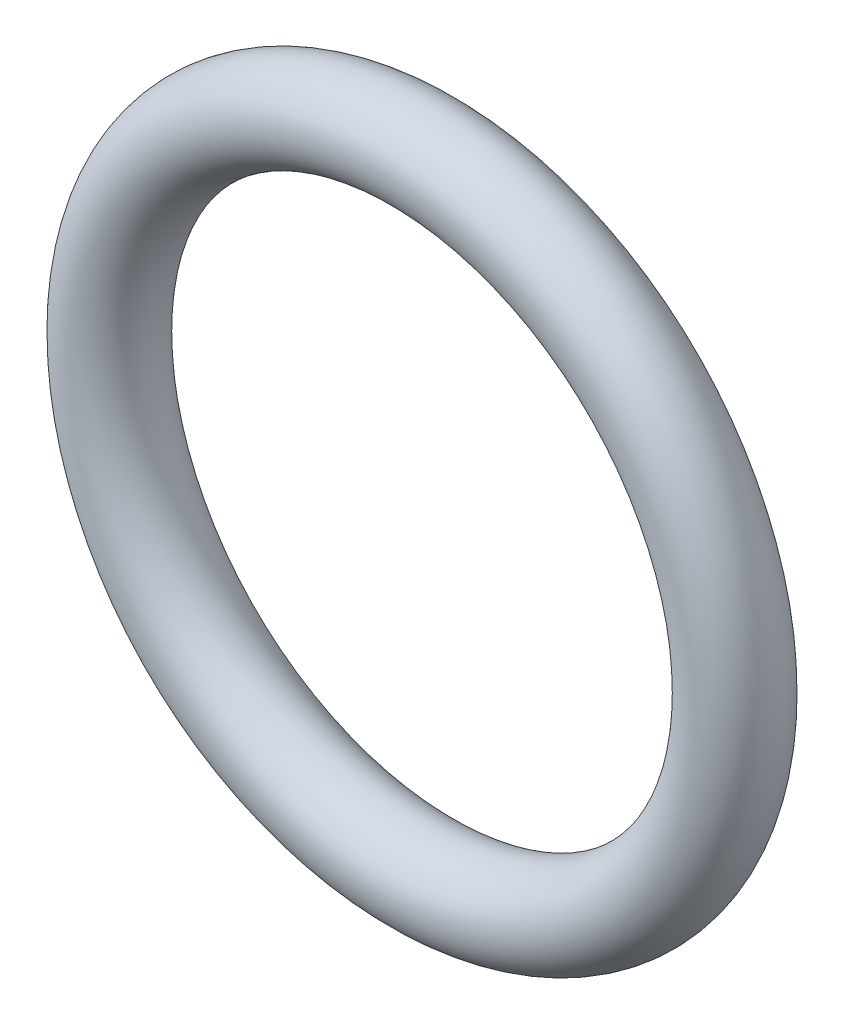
from build123d import *

# Parameters (mm, degrees)
SKETCH1_R = 0.889


with BuildPart() as part:
    # Sweep1: sweep along a path in Sketch3
    with BuildLine(Plane.XY) as sweep1_path:
        CenterArc((6.2992, 0), 6.2992, 0, 360)
    # Sketch1 → Sweep1 (sweep)
    with BuildSketch(Plane(origin=(0, 0, 0), x_dir=(1, 0, 0), z_dir=(0, 1, 0))):
        Circle(SKETCH1_R)
    sweep(path=sweep1_path.line)


solid = part.part
